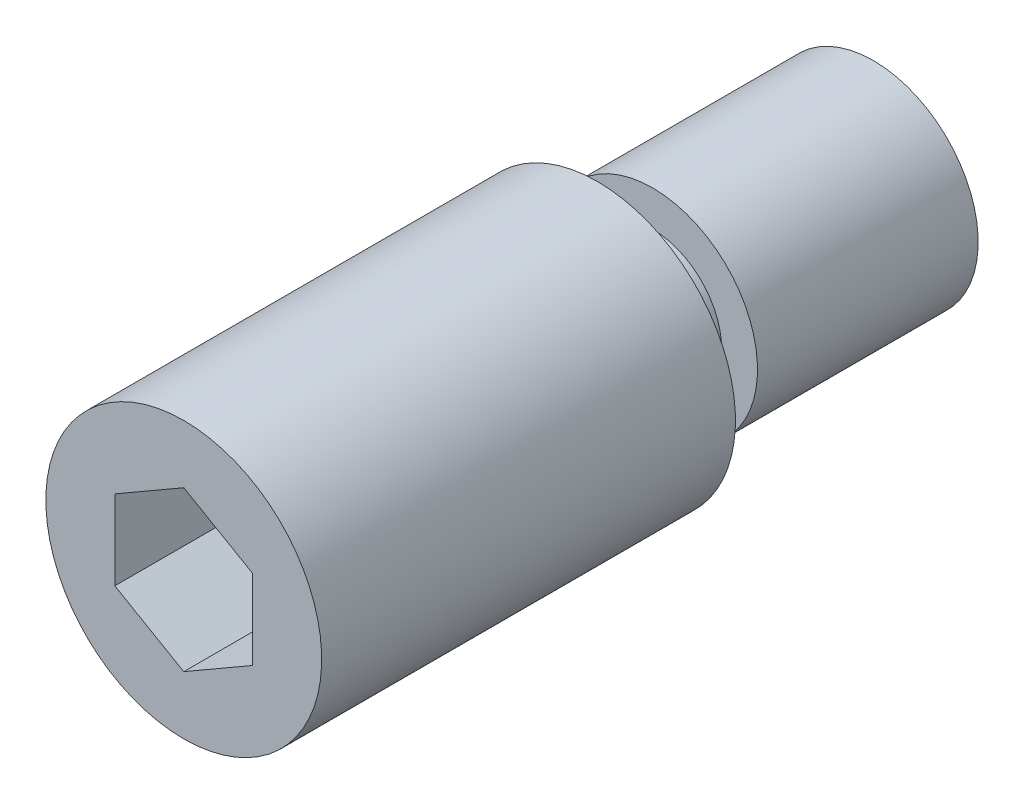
ISO-10303-21;
HEADER;
FILE_DESCRIPTION(('STEP AP214'),'2;1');
FILE_NAME('part.step','',(''),(''),'','','');
FILE_SCHEMA(('AUTOMOTIVE_DESIGN { 1 0 10303 214 1 1 1 1 }'));
ENDSEC;
DATA;
#1=APPLICATION_CONTEXT('core data for automotive mechanical design processes');
#2=APPLICATION_PROTOCOL_DEFINITION('international standard','automotive_design',2000,#1);
#3=PRODUCT_CONTEXT('',#1,'mechanical');
#4=PRODUCT('Part','Part','',(#3));
#5=PRODUCT_RELATED_PRODUCT_CATEGORY('part','',(#4));
#6=PRODUCT_DEFINITION_FORMATION('','',#4);
#7=PRODUCT_DEFINITION_CONTEXT('part definition',#1,'design');
#8=PRODUCT_DEFINITION('design','',#6,#7);
#9=PRODUCT_DEFINITION_SHAPE('','',#8);
#10=(LENGTH_UNIT() NAMED_UNIT(*) SI_UNIT(.MILLI.,.METRE.));
#11=(NAMED_UNIT(*) PLANE_ANGLE_UNIT() SI_UNIT($,.RADIAN.));
#12=(NAMED_UNIT(*) SI_UNIT($,.STERADIAN.) SOLID_ANGLE_UNIT());
#13=UNCERTAINTY_MEASURE_WITH_UNIT(LENGTH_MEASURE(1.E-05),#10,'distance_accuracy_value','');
#14=(GEOMETRIC_REPRESENTATION_CONTEXT(3) GLOBAL_UNCERTAINTY_ASSIGNED_CONTEXT((#13)) GLOBAL_UNIT_ASSIGNED_CONTEXT((#10,
#11,#12)) REPRESENTATION_CONTEXT('',''));
#15=CARTESIAN_POINT('',(0.,0.,0.));
#16=DIRECTION('',(0.,0.,1.));
#17=DIRECTION('',(1.,0.,0.));
#18=AXIS2_PLACEMENT_3D('',#15,#16,#17);
#19=CARTESIAN_POINT('',(0.,-5.,10.));
#20=DIRECTION('',(0.,0.,-1.));
#21=DIRECTION('',(0.,-1.,0.));
#22=AXIS2_PLACEMENT_3D('',#19,#20,#21);
#23=PLANE('',#22);
#24=CARTESIAN_POINT('',(0.,0.,10.));
#25=DIRECTION('',(0.,0.,1.));
#26=DIRECTION('',(0.,1.,0.));
#27=AXIS2_PLACEMENT_3D('',#24,#25,#26);
#28=CIRCLE('',#27,2.5);
#29=CARTESIAN_POINT('',(0.,2.5,10.));
#30=VERTEX_POINT('',#29);
#31=EDGE_CURVE('E115',#30,#30,#28,.T.);
#32=ORIENTED_EDGE('',*,*,#31,.T.);
#33=EDGE_LOOP('',(#32));
#34=FACE_BOUND('',#33,.T.);
#35=CARTESIAN_POINT('',(0.,0.,10.));
#36=DIRECTION('',(0.,0.,1.));
#37=DIRECTION('',(0.,1.,0.));
#38=AXIS2_PLACEMENT_3D('',#35,#36,#37);
#39=CIRCLE('',#38,5.);
#40=CARTESIAN_POINT('',(0.,5.,10.));
#41=VERTEX_POINT('',#40);
#42=EDGE_CURVE('E9',#41,#41,#39,.T.);
#43=ORIENTED_EDGE('',*,*,#42,.F.);
#44=EDGE_LOOP('',(#43));
#45=FACE_BOUND('',#44,.T.);
#46=ADVANCED_FACE('F14',(#34,#45),#23,.T.);
#47=CARTESIAN_POINT('',(0.,0.,20.));
#48=DIRECTION('',(0.,0.,1.));
#49=DIRECTION('',(0.,1.,0.));
#50=AXIS2_PLACEMENT_3D('',#47,#48,#49);
#51=CYLINDRICAL_SURFACE('',#50,5.);
#52=CARTESIAN_POINT('',(0.,0.,25.));
#53=DIRECTION('',(0.,0.,1.));
#54=DIRECTION('',(0.,1.,0.));
#55=AXIS2_PLACEMENT_3D('',#52,#53,#54);
#56=CIRCLE('',#55,5.);
#57=CARTESIAN_POINT('',(0.,5.,25.));
#58=VERTEX_POINT('',#57);
#59=EDGE_CURVE('E21',#58,#58,#56,.T.);
#60=ORIENTED_EDGE('',*,*,#59,.F.);
#61=EDGE_LOOP('',(#60));
#62=FACE_BOUND('',#61,.T.);
#63=ORIENTED_EDGE('',*,*,#42,.T.);
#64=EDGE_LOOP('',(#63));
#65=FACE_BOUND('',#64,.T.);
#66=ADVANCED_FACE('F136',(#62,#65),#51,.T.);
#67=CARTESIAN_POINT('',(0.,-5.,25.));
#68=DIRECTION('',(0.,0.,-1.));
#69=DIRECTION('',(0.,-1.,0.));
#70=AXIS2_PLACEMENT_3D('',#67,#68,#69);
#71=PLANE('',#70);
#72=DIRECTION('',(-0.866025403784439,-0.5,0.));
#73=VECTOR('',#72,1.);
#74=CARTESIAN_POINT('',(0.,2.88675134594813,25.));
#75=LINE('',#74,#73);
#76=CARTESIAN_POINT('',(0.,2.88675134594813,25.));
#77=VERTEX_POINT('',#76);
#78=CARTESIAN_POINT('',(-2.5,1.44337567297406,25.));
#79=VERTEX_POINT('',#78);
#80=EDGE_CURVE('E102',#77,#79,#75,.T.);
#81=ORIENTED_EDGE('',*,*,#80,.F.);
#82=DIRECTION('',(-0.866025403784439,0.5,0.));
#83=VECTOR('',#82,1.);
#84=CARTESIAN_POINT('',(2.5,1.44337567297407,25.));
#85=LINE('',#84,#83);
#86=CARTESIAN_POINT('',(2.5,1.44337567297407,25.));
#87=VERTEX_POINT('',#86);
#88=EDGE_CURVE('E28',#87,#77,#85,.T.);
#89=ORIENTED_EDGE('',*,*,#88,.F.);
#90=DIRECTION('',(0.,1.,0.));
#91=VECTOR('',#90,1.);
#92=CARTESIAN_POINT('',(2.5,-1.44337567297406,25.));
#93=LINE('',#92,#91);
#94=CARTESIAN_POINT('',(2.5,-1.44337567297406,25.));
#95=VERTEX_POINT('',#94);
#96=EDGE_CURVE('E111',#95,#87,#93,.T.);
#97=ORIENTED_EDGE('',*,*,#96,.F.);
#98=DIRECTION('',(0.866025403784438,0.5,0.));
#99=VECTOR('',#98,1.);
#100=CARTESIAN_POINT('',(0.,-2.88675134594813,25.));
#101=LINE('',#100,#99);
#102=CARTESIAN_POINT('',(0.,-2.88675134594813,25.));
#103=VERTEX_POINT('',#102);
#104=EDGE_CURVE('E109',#103,#95,#101,.T.);
#105=ORIENTED_EDGE('',*,*,#104,.F.);
#106=DIRECTION('',(0.866025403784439,-0.5,0.));
#107=VECTOR('',#106,1.);
#108=CARTESIAN_POINT('',(-2.5,-1.44337567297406,25.));
#109=LINE('',#108,#107);
#110=CARTESIAN_POINT('',(-2.5,-1.44337567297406,25.));
#111=VERTEX_POINT('',#110);
#112=EDGE_CURVE('E76',#111,#103,#109,.T.);
#113=ORIENTED_EDGE('',*,*,#112,.F.);
#114=DIRECTION('',(0.,-1.,0.));
#115=VECTOR('',#114,1.);
#116=CARTESIAN_POINT('',(-2.5,1.44337567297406,25.));
#117=LINE('',#116,#115);
#118=EDGE_CURVE('E105',#79,#111,#117,.T.);
#119=ORIENTED_EDGE('',*,*,#118,.F.);
#120=EDGE_LOOP('',(#81,#89,#97,#105,#113,#119));
#121=FACE_BOUND('',#120,.T.);
#122=ORIENTED_EDGE('',*,*,#59,.T.);
#123=EDGE_LOOP('',(#122));
#124=FACE_BOUND('',#123,.T.);
#125=ADVANCED_FACE('F134',(#121,#124),#71,.F.);
#126=CARTESIAN_POINT('',(0.,-3.8,0.));
#127=DIRECTION('',(0.,0.,-1.));
#128=DIRECTION('',(0.,-1.,0.));
#129=AXIS2_PLACEMENT_3D('',#126,#127,#128);
#130=PLANE('',#129);
#131=CARTESIAN_POINT('',(0.,0.,0.));
#132=DIRECTION('',(0.,0.,1.));
#133=DIRECTION('',(0.,1.,0.));
#134=AXIS2_PLACEMENT_3D('',#131,#132,#133);
#135=CIRCLE('',#134,3.8);
#136=CARTESIAN_POINT('',(0.,3.8,0.));
#137=VERTEX_POINT('',#136);
#138=EDGE_CURVE('E129',#137,#137,#135,.T.);
#139=ORIENTED_EDGE('',*,*,#138,.F.);
#140=EDGE_LOOP('',(#139));
#141=FACE_BOUND('',#140,.T.);
#142=ADVANCED_FACE('F167',(#141),#130,.T.);
#143=CARTESIAN_POINT('',(0.,0.,20.));
#144=DIRECTION('',(0.,0.,1.));
#145=DIRECTION('',(0.,1.,0.));
#146=AXIS2_PLACEMENT_3D('',#143,#144,#145);
#147=CYLINDRICAL_SURFACE('',#146,3.8);
#148=ORIENTED_EDGE('',*,*,#138,.T.);
#149=EDGE_LOOP('',(#148));
#150=FACE_BOUND('',#149,.T.);
#151=CARTESIAN_POINT('',(0.,0.,8.));
#152=DIRECTION('',(0.,0.,1.));
#153=DIRECTION('',(0.,1.,0.));
#154=AXIS2_PLACEMENT_3D('',#151,#152,#153);
#155=CIRCLE('',#154,3.8);
#156=CARTESIAN_POINT('',(0.,3.8,8.));
#157=VERTEX_POINT('',#156);
#158=EDGE_CURVE('E126',#157,#157,#155,.T.);
#159=ORIENTED_EDGE('',*,*,#158,.F.);
#160=EDGE_LOOP('',(#159));
#161=FACE_BOUND('',#160,.T.);
#162=ADVANCED_FACE('F160',(#150,#161),#147,.T.);
#163=CARTESIAN_POINT('',(0.,-2.5,8.));
#164=DIRECTION('',(0.,0.,1.));
#165=DIRECTION('',(0.,1.,0.));
#166=AXIS2_PLACEMENT_3D('',#163,#164,#165);
#167=PLANE('',#166);
#168=ORIENTED_EDGE('',*,*,#158,.T.);
#169=EDGE_LOOP('',(#168));
#170=FACE_BOUND('',#169,.T.);
#171=CARTESIAN_POINT('',(0.,0.,8.));
#172=DIRECTION('',(0.,0.,1.));
#173=DIRECTION('',(0.,1.,0.));
#174=AXIS2_PLACEMENT_3D('',#171,#172,#173);
#175=CIRCLE('',#174,2.5);
#176=CARTESIAN_POINT('',(0.,2.5,8.));
#177=VERTEX_POINT('',#176);
#178=EDGE_CURVE('E123',#177,#177,#175,.T.);
#179=ORIENTED_EDGE('',*,*,#178,.F.);
#180=EDGE_LOOP('',(#179));
#181=FACE_BOUND('',#180,.T.);
#182=ADVANCED_FACE('F151',(#170,#181),#167,.T.);
#183=CARTESIAN_POINT('',(0.,0.,20.));
#184=DIRECTION('',(0.,0.,1.));
#185=DIRECTION('',(0.,1.,0.));
#186=AXIS2_PLACEMENT_3D('',#183,#184,#185);
#187=CYLINDRICAL_SURFACE('',#186,2.5);
#188=ORIENTED_EDGE('',*,*,#178,.T.);
#189=EDGE_LOOP('',(#188));
#190=FACE_BOUND('',#189,.T.);
#191=ORIENTED_EDGE('',*,*,#31,.F.);
#192=EDGE_LOOP('',(#191));
#193=FACE_BOUND('',#192,.T.);
#194=ADVANCED_FACE('F148',(#190,#193),#187,.T.);
#195=CARTESIAN_POINT('',(2.5,1.44337567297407,19.));
#196=DIRECTION('',(0.5,0.866025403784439,0.));
#197=DIRECTION('',(-0.866025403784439,0.5,0.));
#198=AXIS2_PLACEMENT_3D('',#195,#196,#197);
#199=PLANE('',#198);
#200=ORIENTED_EDGE('',*,*,#88,.T.);
#201=DIRECTION('',(0.,0.,1.));
#202=VECTOR('',#201,1.);
#203=CARTESIAN_POINT('',(0.,2.88675134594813,19.));
#204=LINE('',#203,#202);
#205=CARTESIAN_POINT('',(0.,2.88675134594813,19.));
#206=VERTEX_POINT('',#205);
#207=EDGE_CURVE('E58',#206,#77,#204,.T.);
#208=ORIENTED_EDGE('',*,*,#207,.F.);
#209=DIRECTION('',(-0.866025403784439,0.5,0.));
#210=VECTOR('',#209,1.);
#211=CARTESIAN_POINT('',(2.5,1.44337567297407,19.));
#212=LINE('',#211,#210);
#213=CARTESIAN_POINT('',(2.5,1.44337567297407,19.));
#214=VERTEX_POINT('',#213);
#215=EDGE_CURVE('E113',#214,#206,#212,.T.);
#216=ORIENTED_EDGE('',*,*,#215,.F.);
#217=DIRECTION('',(0.,0.,1.));
#218=VECTOR('',#217,1.);
#219=CARTESIAN_POINT('',(2.5,1.44337567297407,19.));
#220=LINE('',#219,#218);
#221=EDGE_CURVE('E36',#214,#87,#220,.T.);
#222=ORIENTED_EDGE('',*,*,#221,.T.);
#223=EDGE_LOOP('',(#200,#208,#216,#222));
#224=FACE_BOUND('',#223,.T.);
#225=ADVANCED_FACE('F150',(#224),#199,.F.);
#226=CARTESIAN_POINT('',(2.5,-1.44337567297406,19.));
#227=DIRECTION('',(1.,0.,0.));
#228=DIRECTION('',(0.,0.,-1.));
#229=AXIS2_PLACEMENT_3D('',#226,#227,#228);
#230=PLANE('',#229);
#231=ORIENTED_EDGE('',*,*,#96,.T.);
#232=ORIENTED_EDGE('',*,*,#221,.F.);
#233=DIRECTION('',(0.,1.,0.));
#234=VECTOR('',#233,1.);
#235=CARTESIAN_POINT('',(2.5,-1.44337567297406,19.));
#236=LINE('',#235,#234);
#237=CARTESIAN_POINT('',(2.5,-1.44337567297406,19.));
#238=VERTEX_POINT('',#237);
#239=EDGE_CURVE('E88',#238,#214,#236,.T.);
#240=ORIENTED_EDGE('',*,*,#239,.F.);
#241=DIRECTION('',(0.,0.,1.));
#242=VECTOR('',#241,1.);
#243=CARTESIAN_POINT('',(2.5,-1.44337567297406,19.));
#244=LINE('',#243,#242);
#245=EDGE_CURVE('E80',#238,#95,#244,.T.);
#246=ORIENTED_EDGE('',*,*,#245,.T.);
#247=EDGE_LOOP('',(#231,#232,#240,#246));
#248=FACE_BOUND('',#247,.T.);
#249=ADVANCED_FACE('F158',(#248),#230,.F.);
#250=CARTESIAN_POINT('',(0.,-2.88675134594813,19.));
#251=DIRECTION('',(0.5,-0.866025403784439,0.));
#252=DIRECTION('',(0.866025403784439,0.5,0.));
#253=AXIS2_PLACEMENT_3D('',#250,#251,#252);
#254=PLANE('',#253);
#255=ORIENTED_EDGE('',*,*,#104,.T.);
#256=ORIENTED_EDGE('',*,*,#245,.F.);
#257=DIRECTION('',(0.866025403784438,0.5,0.));
#258=VECTOR('',#257,1.);
#259=CARTESIAN_POINT('',(0.,-2.88675134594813,19.));
#260=LINE('',#259,#258);
#261=CARTESIAN_POINT('',(0.,-2.88675134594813,19.));
#262=VERTEX_POINT('',#261);
#263=EDGE_CURVE('E84',#262,#238,#260,.T.);
#264=ORIENTED_EDGE('',*,*,#263,.F.);
#265=DIRECTION('',(0.,0.,1.));
#266=VECTOR('',#265,1.);
#267=CARTESIAN_POINT('',(0.,-2.88675134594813,19.));
#268=LINE('',#267,#266);
#269=EDGE_CURVE('E69',#262,#103,#268,.T.);
#270=ORIENTED_EDGE('',*,*,#269,.T.);
#271=EDGE_LOOP('',(#255,#256,#264,#270));
#272=FACE_BOUND('',#271,.T.);
#273=ADVANCED_FACE('F85',(#272),#254,.F.);
#274=CARTESIAN_POINT('',(-2.5,-1.44337567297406,19.));
#275=DIRECTION('',(-0.5,-0.866025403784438,0.));
#276=DIRECTION('',(0.866025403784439,-0.5,0.));
#277=AXIS2_PLACEMENT_3D('',#274,#275,#276);
#278=PLANE('',#277);
#279=ORIENTED_EDGE('',*,*,#112,.T.);
#280=ORIENTED_EDGE('',*,*,#269,.F.);
#281=DIRECTION('',(0.866025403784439,-0.5,0.));
#282=VECTOR('',#281,1.);
#283=CARTESIAN_POINT('',(-2.5,-1.44337567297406,19.));
#284=LINE('',#283,#282);
#285=CARTESIAN_POINT('',(-2.5,-1.44337567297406,19.));
#286=VERTEX_POINT('',#285);
#287=EDGE_CURVE('E73',#286,#262,#284,.T.);
#288=ORIENTED_EDGE('',*,*,#287,.F.);
#289=DIRECTION('',(0.,0.,1.));
#290=VECTOR('',#289,1.);
#291=CARTESIAN_POINT('',(-2.5,-1.44337567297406,19.));
#292=LINE('',#291,#290);
#293=EDGE_CURVE('E81',#286,#111,#292,.T.);
#294=ORIENTED_EDGE('',*,*,#293,.T.);
#295=EDGE_LOOP('',(#279,#280,#288,#294));
#296=FACE_BOUND('',#295,.T.);
#297=ADVANCED_FACE('F71',(#296),#278,.F.);
#298=CARTESIAN_POINT('',(-2.5,1.44337567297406,19.));
#299=DIRECTION('',(-1.,0.,0.));
#300=DIRECTION('',(0.,-1.,0.));
#301=AXIS2_PLACEMENT_3D('',#298,#299,#300);
#302=PLANE('',#301);
#303=ORIENTED_EDGE('',*,*,#118,.T.);
#304=ORIENTED_EDGE('',*,*,#293,.F.);
#305=DIRECTION('',(0.,-1.,0.));
#306=VECTOR('',#305,1.);
#307=CARTESIAN_POINT('',(-2.5,1.44337567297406,19.));
#308=LINE('',#307,#306);
#309=CARTESIAN_POINT('',(-2.5,1.44337567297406,19.));
#310=VERTEX_POINT('',#309);
#311=EDGE_CURVE('E94',#310,#286,#308,.T.);
#312=ORIENTED_EDGE('',*,*,#311,.F.);
#313=DIRECTION('',(0.,0.,1.));
#314=VECTOR('',#313,1.);
#315=CARTESIAN_POINT('',(-2.5,1.44337567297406,19.));
#316=LINE('',#315,#314);
#317=EDGE_CURVE('E118',#310,#79,#316,.T.);
#318=ORIENTED_EDGE('',*,*,#317,.T.);
#319=EDGE_LOOP('',(#303,#304,#312,#318));
#320=FACE_BOUND('',#319,.T.);
#321=ADVANCED_FACE('F192',(#320),#302,.F.);
#322=CARTESIAN_POINT('',(0.,2.88675134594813,19.));
#323=DIRECTION('',(-0.5,0.866025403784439,0.));
#324=DIRECTION('',(-0.866025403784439,-0.5,0.));
#325=AXIS2_PLACEMENT_3D('',#322,#323,#324);
#326=PLANE('',#325);
#327=ORIENTED_EDGE('',*,*,#80,.T.);
#328=ORIENTED_EDGE('',*,*,#317,.F.);
#329=DIRECTION('',(-0.866025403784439,-0.5,0.));
#330=VECTOR('',#329,1.);
#331=CARTESIAN_POINT('',(0.,2.88675134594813,19.));
#332=LINE('',#331,#330);
#333=EDGE_CURVE('E96',#206,#310,#332,.T.);
#334=ORIENTED_EDGE('',*,*,#333,.F.);
#335=ORIENTED_EDGE('',*,*,#207,.T.);
#336=EDGE_LOOP('',(#327,#328,#334,#335));
#337=FACE_BOUND('',#336,.T.);
#338=ADVANCED_FACE('F180',(#337),#326,.F.);
#339=CARTESIAN_POINT('',(0.,2.88675134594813,19.));
#340=DIRECTION('',(0.,0.,1.));
#341=DIRECTION('',(1.,0.,0.));
#342=AXIS2_PLACEMENT_3D('',#339,#340,#341);
#343=PLANE('',#342);
#344=ORIENTED_EDGE('',*,*,#215,.T.);
#345=ORIENTED_EDGE('',*,*,#333,.T.);
#346=ORIENTED_EDGE('',*,*,#311,.T.);
#347=ORIENTED_EDGE('',*,*,#287,.T.);
#348=ORIENTED_EDGE('',*,*,#263,.T.);
#349=ORIENTED_EDGE('',*,*,#239,.T.);
#350=EDGE_LOOP('',(#344,#345,#346,#347,#348,#349));
#351=FACE_BOUND('',#350,.T.);
#352=ADVANCED_FACE('F91',(#351),#343,.T.);
#353=CLOSED_SHELL('',(#46,#66,#125,#142,#162,#182,#194,#225,#249,#273,#297,#321,#338,#352));
#354=MANIFOLD_SOLID_BREP('B1',#353);
#355=ADVANCED_BREP_SHAPE_REPRESENTATION('',(#18,#354),#14);
#356=SHAPE_DEFINITION_REPRESENTATION(#9,#355);
ENDSEC;
END-ISO-10303-21;
